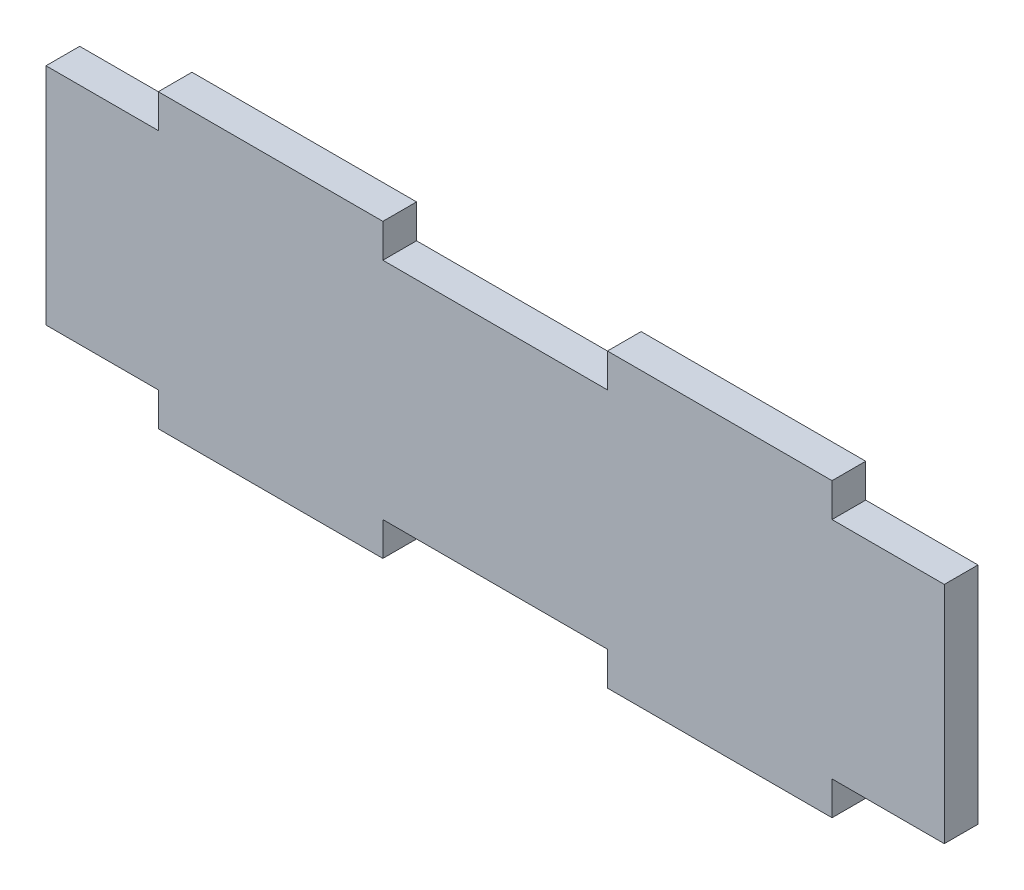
ISO-10303-21;
HEADER;
FILE_DESCRIPTION(('STEP AP214'),'2;1');
FILE_NAME('part.step','',(''),(''),'','','');
FILE_SCHEMA(('AUTOMOTIVE_DESIGN { 1 0 10303 214 1 1 1 1 }'));
ENDSEC;
DATA;
#1=APPLICATION_CONTEXT('core data for automotive mechanical design processes');
#2=APPLICATION_PROTOCOL_DEFINITION('international standard','automotive_design',2000,#1);
#3=PRODUCT_CONTEXT('',#1,'mechanical');
#4=PRODUCT('Part','Part','',(#3));
#5=PRODUCT_RELATED_PRODUCT_CATEGORY('part','',(#4));
#6=PRODUCT_DEFINITION_FORMATION('','',#4);
#7=PRODUCT_DEFINITION_CONTEXT('part definition',#1,'design');
#8=PRODUCT_DEFINITION('design','',#6,#7);
#9=PRODUCT_DEFINITION_SHAPE('','',#8);
#10=(LENGTH_UNIT() NAMED_UNIT(*) SI_UNIT(.MILLI.,.METRE.));
#11=(NAMED_UNIT(*) PLANE_ANGLE_UNIT() SI_UNIT($,.RADIAN.));
#12=(NAMED_UNIT(*) SI_UNIT($,.STERADIAN.) SOLID_ANGLE_UNIT());
#13=UNCERTAINTY_MEASURE_WITH_UNIT(LENGTH_MEASURE(1.E-05),#10,'distance_accuracy_value','');
#14=(GEOMETRIC_REPRESENTATION_CONTEXT(3) GLOBAL_UNCERTAINTY_ASSIGNED_CONTEXT((#13)) GLOBAL_UNIT_ASSIGNED_CONTEXT((#10,
#11,#12)) REPRESENTATION_CONTEXT('',''));
#15=CARTESIAN_POINT('',(0.,0.,0.));
#16=DIRECTION('',(0.,0.,1.));
#17=DIRECTION('',(1.,0.,0.));
#18=AXIS2_PLACEMENT_3D('',#15,#16,#17);
#19=CARTESIAN_POINT('',(0.,0.,3.));
#20=DIRECTION('',(-1.,0.,0.));
#21=DIRECTION('',(0.,0.,1.));
#22=AXIS2_PLACEMENT_3D('',#19,#20,#21);
#23=PLANE('',#22);
#24=DIRECTION('',(0.,1.,0.));
#25=VECTOR('',#24,1.);
#26=CARTESIAN_POINT('',(0.,0.,0.));
#27=LINE('',#26,#25);
#28=CARTESIAN_POINT('',(0.,0.,0.));
#29=VERTEX_POINT('',#28);
#30=CARTESIAN_POINT('',(0.,20.,0.));
#31=VERTEX_POINT('',#30);
#32=EDGE_CURVE('E171',#29,#31,#27,.T.);
#33=ORIENTED_EDGE('',*,*,#32,.F.);
#34=DIRECTION('',(0.,0.,-1.));
#35=VECTOR('',#34,1.);
#36=CARTESIAN_POINT('',(0.,0.,3.));
#37=LINE('',#36,#35);
#38=CARTESIAN_POINT('',(0.,0.,3.));
#39=VERTEX_POINT('',#38);
#40=EDGE_CURVE('E183',#39,#29,#37,.T.);
#41=ORIENTED_EDGE('',*,*,#40,.F.);
#42=DIRECTION('',(0.,1.,0.));
#43=VECTOR('',#42,1.);
#44=CARTESIAN_POINT('',(0.,0.,3.));
#45=LINE('',#44,#43);
#46=CARTESIAN_POINT('',(0.,20.,3.));
#47=VERTEX_POINT('',#46);
#48=EDGE_CURVE('E179',#39,#47,#45,.T.);
#49=ORIENTED_EDGE('',*,*,#48,.T.);
#50=DIRECTION('',(0.,0.,-1.));
#51=VECTOR('',#50,1.);
#52=CARTESIAN_POINT('',(0.,20.,3.));
#53=LINE('',#52,#51);
#54=EDGE_CURVE('E201',#47,#31,#53,.T.);
#55=ORIENTED_EDGE('',*,*,#54,.T.);
#56=EDGE_LOOP('',(#33,#41,#49,#55));
#57=FACE_BOUND('',#56,.T.);
#58=ADVANCED_FACE('F34',(#57),#23,.T.);
#59=CARTESIAN_POINT('',(80.,0.,3.));
#60=DIRECTION('',(-1.,0.,0.));
#61=DIRECTION('',(0.,0.,1.));
#62=AXIS2_PLACEMENT_3D('',#59,#60,#61);
#63=PLANE('',#62);
#64=DIRECTION('',(0.,1.,0.));
#65=VECTOR('',#64,1.);
#66=CARTESIAN_POINT('',(80.,0.,0.));
#67=LINE('',#66,#65);
#68=CARTESIAN_POINT('',(80.,0.,0.));
#69=VERTEX_POINT('',#68);
#70=CARTESIAN_POINT('',(80.,20.,0.));
#71=VERTEX_POINT('',#70);
#72=EDGE_CURVE('E187',#69,#71,#67,.T.);
#73=ORIENTED_EDGE('',*,*,#72,.T.);
#74=DIRECTION('',(0.,0.,-1.));
#75=VECTOR('',#74,1.);
#76=CARTESIAN_POINT('',(80.,20.,3.));
#77=LINE('',#76,#75);
#78=CARTESIAN_POINT('',(80.,20.,3.));
#79=VERTEX_POINT('',#78);
#80=EDGE_CURVE('E204',#79,#71,#77,.T.);
#81=ORIENTED_EDGE('',*,*,#80,.F.);
#82=DIRECTION('',(0.,1.,0.));
#83=VECTOR('',#82,1.);
#84=CARTESIAN_POINT('',(80.,0.,3.));
#85=LINE('',#84,#83);
#86=CARTESIAN_POINT('',(80.,0.,3.));
#87=VERTEX_POINT('',#86);
#88=EDGE_CURVE('E169',#87,#79,#85,.T.);
#89=ORIENTED_EDGE('',*,*,#88,.F.);
#90=DIRECTION('',(0.,0.,-1.));
#91=VECTOR('',#90,1.);
#92=CARTESIAN_POINT('',(80.,0.,3.));
#93=LINE('',#92,#91);
#94=EDGE_CURVE('E207',#87,#69,#93,.T.);
#95=ORIENTED_EDGE('',*,*,#94,.T.);
#96=EDGE_LOOP('',(#73,#81,#89,#95));
#97=FACE_BOUND('',#96,.T.);
#98=ADVANCED_FACE('F370',(#97),#63,.F.);
#99=CARTESIAN_POINT('',(0.,0.,0.));
#100=DIRECTION('',(0.,0.,1.));
#101=DIRECTION('',(1.,0.,0.));
#102=AXIS2_PLACEMENT_3D('',#99,#100,#101);
#103=PLANE('',#102);
#104=DIRECTION('',(1.,0.,0.));
#105=VECTOR('',#104,1.);
#106=CARTESIAN_POINT('',(0.,0.,0.));
#107=LINE('',#106,#105);
#108=CARTESIAN_POINT('',(10.,0.,0.));
#109=VERTEX_POINT('',#108);
#110=EDGE_CURVE('E184',#29,#109,#107,.T.);
#111=ORIENTED_EDGE('',*,*,#110,.F.);
#112=ORIENTED_EDGE('',*,*,#32,.T.);
#113=DIRECTION('',(1.,0.,0.));
#114=VECTOR('',#113,1.);
#115=CARTESIAN_POINT('',(0.,20.,0.));
#116=LINE('',#115,#114);
#117=CARTESIAN_POINT('',(10.,20.,0.));
#118=VERTEX_POINT('',#117);
#119=EDGE_CURVE('E193',#31,#118,#116,.T.);
#120=ORIENTED_EDGE('',*,*,#119,.T.);
#121=DIRECTION('',(0.,1.,0.));
#122=VECTOR('',#121,1.);
#123=CARTESIAN_POINT('',(10.,20.,0.));
#124=LINE('',#123,#122);
#125=CARTESIAN_POINT('',(10.,23.,0.));
#126=VERTEX_POINT('',#125);
#127=EDGE_CURVE('E221',#118,#126,#124,.T.);
#128=ORIENTED_EDGE('',*,*,#127,.T.);
#129=DIRECTION('',(1.,0.,0.));
#130=VECTOR('',#129,1.);
#131=CARTESIAN_POINT('',(10.,23.,0.));
#132=LINE('',#131,#130);
#133=CARTESIAN_POINT('',(30.,23.,0.));
#134=VERTEX_POINT('',#133);
#135=EDGE_CURVE('E224',#126,#134,#132,.T.);
#136=ORIENTED_EDGE('',*,*,#135,.T.);
#137=DIRECTION('',(0.,1.,0.));
#138=VECTOR('',#137,1.);
#139=CARTESIAN_POINT('',(30.,20.,0.));
#140=LINE('',#139,#138);
#141=CARTESIAN_POINT('',(30.,20.,0.));
#142=VERTEX_POINT('',#141);
#143=EDGE_CURVE('E215',#142,#134,#140,.T.);
#144=ORIENTED_EDGE('',*,*,#143,.F.);
#145=CARTESIAN_POINT('',(50.,20.,0.));
#146=VERTEX_POINT('',#145);
#147=EDGE_CURVE('E196',#142,#146,#116,.T.);
#148=ORIENTED_EDGE('',*,*,#147,.T.);
#149=DIRECTION('',(0.,1.,0.));
#150=VECTOR('',#149,1.);
#151=CARTESIAN_POINT('',(50.,20.,0.));
#152=LINE('',#151,#150);
#153=CARTESIAN_POINT('',(50.,23.,0.));
#154=VERTEX_POINT('',#153);
#155=EDGE_CURVE('E243',#146,#154,#152,.T.);
#156=ORIENTED_EDGE('',*,*,#155,.T.);
#157=DIRECTION('',(-1.,0.,0.));
#158=VECTOR('',#157,1.);
#159=CARTESIAN_POINT('',(70.,23.,0.));
#160=LINE('',#159,#158);
#161=CARTESIAN_POINT('',(70.,23.,0.));
#162=VERTEX_POINT('',#161);
#163=EDGE_CURVE('E251',#162,#154,#160,.T.);
#164=ORIENTED_EDGE('',*,*,#163,.F.);
#165=DIRECTION('',(0.,1.,0.));
#166=VECTOR('',#165,1.);
#167=CARTESIAN_POINT('',(70.,20.,0.));
#168=LINE('',#167,#166);
#169=CARTESIAN_POINT('',(70.,20.,0.));
#170=VERTEX_POINT('',#169);
#171=EDGE_CURVE('E156',#170,#162,#168,.T.);
#172=ORIENTED_EDGE('',*,*,#171,.F.);
#173=EDGE_CURVE('E192',#170,#71,#116,.T.);
#174=ORIENTED_EDGE('',*,*,#173,.T.);
#175=ORIENTED_EDGE('',*,*,#72,.F.);
#176=CARTESIAN_POINT('',(70.,0.,0.));
#177=VERTEX_POINT('',#176);
#178=EDGE_CURVE('E189',#177,#69,#107,.T.);
#179=ORIENTED_EDGE('',*,*,#178,.F.);
#180=DIRECTION('',(0.,-1.,0.));
#181=VECTOR('',#180,1.);
#182=CARTESIAN_POINT('',(70.,0.,0.));
#183=LINE('',#182,#181);
#184=CARTESIAN_POINT('',(70.,-3.,0.));
#185=VERTEX_POINT('',#184);
#186=EDGE_CURVE('E134',#177,#185,#183,.T.);
#187=ORIENTED_EDGE('',*,*,#186,.T.);
#188=DIRECTION('',(-1.,0.,0.));
#189=VECTOR('',#188,1.);
#190=CARTESIAN_POINT('',(70.,-3.,0.));
#191=LINE('',#190,#189);
#192=CARTESIAN_POINT('',(50.,-3.,0.));
#193=VERTEX_POINT('',#192);
#194=EDGE_CURVE('E113',#185,#193,#191,.T.);
#195=ORIENTED_EDGE('',*,*,#194,.T.);
#196=DIRECTION('',(0.,-1.,0.));
#197=VECTOR('',#196,1.);
#198=CARTESIAN_POINT('',(50.,0.,0.));
#199=LINE('',#198,#197);
#200=CARTESIAN_POINT('',(50.,0.,0.));
#201=VERTEX_POINT('',#200);
#202=EDGE_CURVE('E122',#201,#193,#199,.T.);
#203=ORIENTED_EDGE('',*,*,#202,.F.);
#204=CARTESIAN_POINT('',(30.,0.,0.));
#205=VERTEX_POINT('',#204);
#206=EDGE_CURVE('E188',#205,#201,#107,.T.);
#207=ORIENTED_EDGE('',*,*,#206,.F.);
#208=DIRECTION('',(0.,-1.,0.));
#209=VECTOR('',#208,1.);
#210=CARTESIAN_POINT('',(30.,0.,0.));
#211=LINE('',#210,#209);
#212=CARTESIAN_POINT('',(30.,-3.,0.));
#213=VERTEX_POINT('',#212);
#214=EDGE_CURVE('E267',#205,#213,#211,.T.);
#215=ORIENTED_EDGE('',*,*,#214,.T.);
#216=DIRECTION('',(1.,0.,0.));
#217=VECTOR('',#216,1.);
#218=CARTESIAN_POINT('',(10.,-3.,0.));
#219=LINE('',#218,#217);
#220=CARTESIAN_POINT('',(10.,-3.,0.));
#221=VERTEX_POINT('',#220);
#222=EDGE_CURVE('E272',#221,#213,#219,.T.);
#223=ORIENTED_EDGE('',*,*,#222,.F.);
#224=DIRECTION('',(0.,-1.,0.));
#225=VECTOR('',#224,1.);
#226=CARTESIAN_POINT('',(10.,0.,0.));
#227=LINE('',#226,#225);
#228=EDGE_CURVE('E119',#109,#221,#227,.T.);
#229=ORIENTED_EDGE('',*,*,#228,.F.);
#230=EDGE_LOOP('',(#111,#112,#120,#128,#136,#144,#148,#156,#164,#172,#174,#175,#179,#187,#195,
#203,#207,#215,#223,#229));
#231=FACE_BOUND('',#230,.T.);
#232=ADVANCED_FACE('F132',(#231),#103,.F.);
#233=CARTESIAN_POINT('',(0.,0.,3.));
#234=DIRECTION('',(0.,0.,1.));
#235=DIRECTION('',(1.,0.,0.));
#236=AXIS2_PLACEMENT_3D('',#233,#234,#235);
#237=PLANE('',#236);
#238=DIRECTION('',(1.,0.,0.));
#239=VECTOR('',#238,1.);
#240=CARTESIAN_POINT('',(0.,0.,3.));
#241=LINE('',#240,#239);
#242=CARTESIAN_POINT('',(10.,0.,3.));
#243=VERTEX_POINT('',#242);
#244=EDGE_CURVE('E166',#39,#243,#241,.T.);
#245=ORIENTED_EDGE('',*,*,#244,.T.);
#246=DIRECTION('',(0.,-1.,0.));
#247=VECTOR('',#246,1.);
#248=CARTESIAN_POINT('',(10.,0.,3.));
#249=LINE('',#248,#247);
#250=CARTESIAN_POINT('',(10.,-3.,3.));
#251=VERTEX_POINT('',#250);
#252=EDGE_CURVE('E263',#243,#251,#249,.T.);
#253=ORIENTED_EDGE('',*,*,#252,.T.);
#254=DIRECTION('',(1.,0.,0.));
#255=VECTOR('',#254,1.);
#256=CARTESIAN_POINT('',(10.,-3.,3.));
#257=LINE('',#256,#255);
#258=CARTESIAN_POINT('',(30.,-3.,3.));
#259=VERTEX_POINT('',#258);
#260=EDGE_CURVE('E266',#251,#259,#257,.T.);
#261=ORIENTED_EDGE('',*,*,#260,.T.);
#262=DIRECTION('',(0.,-1.,0.));
#263=VECTOR('',#262,1.);
#264=CARTESIAN_POINT('',(30.,0.,3.));
#265=LINE('',#264,#263);
#266=CARTESIAN_POINT('',(30.,0.,3.));
#267=VERTEX_POINT('',#266);
#268=EDGE_CURVE('E153',#267,#259,#265,.T.);
#269=ORIENTED_EDGE('',*,*,#268,.F.);
#270=CARTESIAN_POINT('',(50.,0.,3.));
#271=VERTEX_POINT('',#270);
#272=EDGE_CURVE('E164',#267,#271,#241,.T.);
#273=ORIENTED_EDGE('',*,*,#272,.T.);
#274=DIRECTION('',(0.,-1.,0.));
#275=VECTOR('',#274,1.);
#276=CARTESIAN_POINT('',(50.,0.,3.));
#277=LINE('',#276,#275);
#278=CARTESIAN_POINT('',(50.,-3.,3.));
#279=VERTEX_POINT('',#278);
#280=EDGE_CURVE('E158',#271,#279,#277,.T.);
#281=ORIENTED_EDGE('',*,*,#280,.T.);
#282=DIRECTION('',(-1.,0.,0.));
#283=VECTOR('',#282,1.);
#284=CARTESIAN_POINT('',(70.,-3.,3.));
#285=LINE('',#284,#283);
#286=CARTESIAN_POINT('',(70.,-3.,3.));
#287=VERTEX_POINT('',#286);
#288=EDGE_CURVE('E116',#287,#279,#285,.T.);
#289=ORIENTED_EDGE('',*,*,#288,.F.);
#290=DIRECTION('',(0.,-1.,0.));
#291=VECTOR('',#290,1.);
#292=CARTESIAN_POINT('',(70.,0.,3.));
#293=LINE('',#292,#291);
#294=CARTESIAN_POINT('',(70.,0.,3.));
#295=VERTEX_POINT('',#294);
#296=EDGE_CURVE('E129',#295,#287,#293,.T.);
#297=ORIENTED_EDGE('',*,*,#296,.F.);
#298=EDGE_CURVE('E167',#295,#87,#241,.T.);
#299=ORIENTED_EDGE('',*,*,#298,.T.);
#300=ORIENTED_EDGE('',*,*,#88,.T.);
#301=DIRECTION('',(1.,0.,0.));
#302=VECTOR('',#301,1.);
#303=CARTESIAN_POINT('',(0.,20.,3.));
#304=LINE('',#303,#302);
#305=CARTESIAN_POINT('',(70.,20.,3.));
#306=VERTEX_POINT('',#305);
#307=EDGE_CURVE('E175',#306,#79,#304,.T.);
#308=ORIENTED_EDGE('',*,*,#307,.F.);
#309=DIRECTION('',(0.,1.,0.));
#310=VECTOR('',#309,1.);
#311=CARTESIAN_POINT('',(70.,20.,3.));
#312=LINE('',#311,#310);
#313=CARTESIAN_POINT('',(70.,23.,3.));
#314=VERTEX_POINT('',#313);
#315=EDGE_CURVE('E239',#306,#314,#312,.T.);
#316=ORIENTED_EDGE('',*,*,#315,.T.);
#317=DIRECTION('',(-1.,0.,0.));
#318=VECTOR('',#317,1.);
#319=CARTESIAN_POINT('',(70.,23.,3.));
#320=LINE('',#319,#318);
#321=CARTESIAN_POINT('',(50.,23.,3.));
#322=VERTEX_POINT('',#321);
#323=EDGE_CURVE('E242',#314,#322,#320,.T.);
#324=ORIENTED_EDGE('',*,*,#323,.T.);
#325=DIRECTION('',(0.,1.,0.));
#326=VECTOR('',#325,1.);
#327=CARTESIAN_POINT('',(50.,20.,3.));
#328=LINE('',#327,#326);
#329=CARTESIAN_POINT('',(50.,20.,3.));
#330=VERTEX_POINT('',#329);
#331=EDGE_CURVE('E245',#330,#322,#328,.T.);
#332=ORIENTED_EDGE('',*,*,#331,.F.);
#333=CARTESIAN_POINT('',(30.,20.,3.));
#334=VERTEX_POINT('',#333);
#335=EDGE_CURVE('E180',#334,#330,#304,.T.);
#336=ORIENTED_EDGE('',*,*,#335,.F.);
#337=DIRECTION('',(0.,1.,0.));
#338=VECTOR('',#337,1.);
#339=CARTESIAN_POINT('',(30.,20.,3.));
#340=LINE('',#339,#338);
#341=CARTESIAN_POINT('',(30.,23.,3.));
#342=VERTEX_POINT('',#341);
#343=EDGE_CURVE('E218',#334,#342,#340,.T.);
#344=ORIENTED_EDGE('',*,*,#343,.T.);
#345=DIRECTION('',(1.,0.,0.));
#346=VECTOR('',#345,1.);
#347=CARTESIAN_POINT('',(10.,23.,3.));
#348=LINE('',#347,#346);
#349=CARTESIAN_POINT('',(10.,23.,3.));
#350=VERTEX_POINT('',#349);
#351=EDGE_CURVE('E214',#350,#342,#348,.T.);
#352=ORIENTED_EDGE('',*,*,#351,.F.);
#353=DIRECTION('',(0.,1.,0.));
#354=VECTOR('',#353,1.);
#355=CARTESIAN_POINT('',(10.,20.,3.));
#356=LINE('',#355,#354);
#357=CARTESIAN_POINT('',(10.,20.,3.));
#358=VERTEX_POINT('',#357);
#359=EDGE_CURVE('E211',#358,#350,#356,.T.);
#360=ORIENTED_EDGE('',*,*,#359,.F.);
#361=EDGE_CURVE('E176',#47,#358,#304,.T.);
#362=ORIENTED_EDGE('',*,*,#361,.F.);
#363=ORIENTED_EDGE('',*,*,#48,.F.);
#364=EDGE_LOOP('',(#245,#253,#261,#269,#273,#281,#289,#297,#299,#300,#308,#316,#324,#332,#336,
#344,#352,#360,#362,#363));
#365=FACE_BOUND('',#364,.T.);
#366=ADVANCED_FACE('F162',(#365),#237,.T.);
#367=CARTESIAN_POINT('',(0.,20.,3.));
#368=DIRECTION('',(0.,1.,0.));
#369=DIRECTION('',(0.,0.,1.));
#370=AXIS2_PLACEMENT_3D('',#367,#368,#369);
#371=PLANE('',#370);
#372=DIRECTION('',(0.,0.,-1.));
#373=VECTOR('',#372,1.);
#374=CARTESIAN_POINT('',(30.,20.,3.));
#375=LINE('',#374,#373);
#376=EDGE_CURVE('E140',#334,#142,#375,.T.);
#377=ORIENTED_EDGE('',*,*,#376,.F.);
#378=ORIENTED_EDGE('',*,*,#335,.T.);
#379=DIRECTION('',(0.,0.,-1.));
#380=VECTOR('',#379,1.);
#381=CARTESIAN_POINT('',(50.,20.,3.));
#382=LINE('',#381,#380);
#383=EDGE_CURVE('E210',#330,#146,#382,.T.);
#384=ORIENTED_EDGE('',*,*,#383,.T.);
#385=ORIENTED_EDGE('',*,*,#147,.F.);
#386=EDGE_LOOP('',(#377,#378,#384,#385));
#387=FACE_BOUND('',#386,.T.);
#388=ADVANCED_FACE('F356',(#387),#371,.T.);
#389=DIRECTION('',(0.,0.,-1.));
#390=VECTOR('',#389,1.);
#391=CARTESIAN_POINT('',(70.,20.,3.));
#392=LINE('',#391,#390);
#393=EDGE_CURVE('E233',#306,#170,#392,.T.);
#394=ORIENTED_EDGE('',*,*,#393,.F.);
#395=ORIENTED_EDGE('',*,*,#307,.T.);
#396=ORIENTED_EDGE('',*,*,#80,.T.);
#397=ORIENTED_EDGE('',*,*,#173,.F.);
#398=EDGE_LOOP('',(#394,#395,#396,#397));
#399=FACE_BOUND('',#398,.T.);
#400=ADVANCED_FACE('F345',(#399),#371,.T.);
#401=ORIENTED_EDGE('',*,*,#361,.T.);
#402=DIRECTION('',(0.,0.,-1.));
#403=VECTOR('',#402,1.);
#404=CARTESIAN_POINT('',(10.,20.,3.));
#405=LINE('',#404,#403);
#406=EDGE_CURVE('E230',#358,#118,#405,.T.);
#407=ORIENTED_EDGE('',*,*,#406,.T.);
#408=ORIENTED_EDGE('',*,*,#119,.F.);
#409=ORIENTED_EDGE('',*,*,#54,.F.);
#410=EDGE_LOOP('',(#401,#407,#408,#409));
#411=FACE_BOUND('',#410,.T.);
#412=ADVANCED_FACE('F398',(#411),#371,.T.);
#413=CARTESIAN_POINT('',(0.,0.,3.));
#414=DIRECTION('',(0.,1.,0.));
#415=DIRECTION('',(0.,0.,1.));
#416=AXIS2_PLACEMENT_3D('',#413,#414,#415);
#417=PLANE('',#416);
#418=ORIENTED_EDGE('',*,*,#298,.F.);
#419=DIRECTION('',(0.,0.,-1.));
#420=VECTOR('',#419,1.);
#421=CARTESIAN_POINT('',(70.,0.,3.));
#422=LINE('',#421,#420);
#423=EDGE_CURVE('E53',#295,#177,#422,.T.);
#424=ORIENTED_EDGE('',*,*,#423,.T.);
#425=ORIENTED_EDGE('',*,*,#178,.T.);
#426=ORIENTED_EDGE('',*,*,#94,.F.);
#427=EDGE_LOOP('',(#418,#424,#425,#426));
#428=FACE_BOUND('',#427,.T.);
#429=ADVANCED_FACE('F374',(#428),#417,.F.);
#430=ORIENTED_EDGE('',*,*,#272,.F.);
#431=DIRECTION('',(0.,0.,-1.));
#432=VECTOR('',#431,1.);
#433=CARTESIAN_POINT('',(30.,0.,3.));
#434=LINE('',#433,#432);
#435=EDGE_CURVE('E44',#267,#205,#434,.T.);
#436=ORIENTED_EDGE('',*,*,#435,.T.);
#437=ORIENTED_EDGE('',*,*,#206,.T.);
#438=DIRECTION('',(0.,0.,-1.));
#439=VECTOR('',#438,1.);
#440=CARTESIAN_POINT('',(50.,0.,3.));
#441=LINE('',#440,#439);
#442=EDGE_CURVE('E125',#271,#201,#441,.T.);
#443=ORIENTED_EDGE('',*,*,#442,.F.);
#444=EDGE_LOOP('',(#430,#436,#437,#443));
#445=FACE_BOUND('',#444,.T.);
#446=ADVANCED_FACE('F402',(#445),#417,.F.);
#447=DIRECTION('',(0.,0.,-1.));
#448=VECTOR('',#447,1.);
#449=CARTESIAN_POINT('',(10.,0.,3.));
#450=LINE('',#449,#448);
#451=EDGE_CURVE('E11',#243,#109,#450,.T.);
#452=ORIENTED_EDGE('',*,*,#451,.F.);
#453=ORIENTED_EDGE('',*,*,#244,.F.);
#454=ORIENTED_EDGE('',*,*,#40,.T.);
#455=ORIENTED_EDGE('',*,*,#110,.T.);
#456=EDGE_LOOP('',(#452,#453,#454,#455));
#457=FACE_BOUND('',#456,.T.);
#458=ADVANCED_FACE('F293',(#457),#417,.F.);
#459=CARTESIAN_POINT('',(70.,23.,3.));
#460=DIRECTION('',(0.,-1.,0.));
#461=DIRECTION('',(0.,0.,-1.));
#462=AXIS2_PLACEMENT_3D('',#459,#460,#461);
#463=PLANE('',#462);
#464=ORIENTED_EDGE('',*,*,#163,.T.);
#465=DIRECTION('',(0.,0.,-1.));
#466=VECTOR('',#465,1.);
#467=CARTESIAN_POINT('',(50.,23.,3.));
#468=LINE('',#467,#466);
#469=EDGE_CURVE('E248',#322,#154,#468,.T.);
#470=ORIENTED_EDGE('',*,*,#469,.F.);
#471=ORIENTED_EDGE('',*,*,#323,.F.);
#472=DIRECTION('',(0.,0.,-1.));
#473=VECTOR('',#472,1.);
#474=CARTESIAN_POINT('',(70.,23.,3.));
#475=LINE('',#474,#473);
#476=EDGE_CURVE('E225',#314,#162,#475,.T.);
#477=ORIENTED_EDGE('',*,*,#476,.T.);
#478=EDGE_LOOP('',(#464,#470,#471,#477));
#479=FACE_BOUND('',#478,.T.);
#480=ADVANCED_FACE('F411',(#479),#463,.F.);
#481=CARTESIAN_POINT('',(50.,20.,3.));
#482=DIRECTION('',(-1.,0.,0.));
#483=DIRECTION('',(0.,0.,1.));
#484=AXIS2_PLACEMENT_3D('',#481,#482,#483);
#485=PLANE('',#484);
#486=ORIENTED_EDGE('',*,*,#155,.F.);
#487=ORIENTED_EDGE('',*,*,#383,.F.);
#488=ORIENTED_EDGE('',*,*,#331,.T.);
#489=ORIENTED_EDGE('',*,*,#469,.T.);
#490=EDGE_LOOP('',(#486,#487,#488,#489));
#491=FACE_BOUND('',#490,.T.);
#492=ADVANCED_FACE('F365',(#491),#485,.T.);
#493=CARTESIAN_POINT('',(70.,20.,3.));
#494=DIRECTION('',(-1.,0.,0.));
#495=DIRECTION('',(0.,0.,1.));
#496=AXIS2_PLACEMENT_3D('',#493,#494,#495);
#497=PLANE('',#496);
#498=ORIENTED_EDGE('',*,*,#171,.T.);
#499=ORIENTED_EDGE('',*,*,#476,.F.);
#500=ORIENTED_EDGE('',*,*,#315,.F.);
#501=ORIENTED_EDGE('',*,*,#393,.T.);
#502=EDGE_LOOP('',(#498,#499,#500,#501));
#503=FACE_BOUND('',#502,.T.);
#504=ADVANCED_FACE('F350',(#503),#497,.F.);
#505=CARTESIAN_POINT('',(10.,23.,3.));
#506=DIRECTION('',(0.,1.,0.));
#507=DIRECTION('',(0.,0.,1.));
#508=AXIS2_PLACEMENT_3D('',#505,#506,#507);
#509=PLANE('',#508);
#510=ORIENTED_EDGE('',*,*,#135,.F.);
#511=DIRECTION('',(0.,0.,-1.));
#512=VECTOR('',#511,1.);
#513=CARTESIAN_POINT('',(10.,23.,3.));
#514=LINE('',#513,#512);
#515=EDGE_CURVE('E220',#350,#126,#514,.T.);
#516=ORIENTED_EDGE('',*,*,#515,.F.);
#517=ORIENTED_EDGE('',*,*,#351,.T.);
#518=DIRECTION('',(0.,0.,-1.));
#519=VECTOR('',#518,1.);
#520=CARTESIAN_POINT('',(30.,23.,3.));
#521=LINE('',#520,#519);
#522=EDGE_CURVE('E236',#342,#134,#521,.T.);
#523=ORIENTED_EDGE('',*,*,#522,.T.);
#524=EDGE_LOOP('',(#510,#516,#517,#523));
#525=FACE_BOUND('',#524,.T.);
#526=ADVANCED_FACE('F376',(#525),#509,.T.);
#527=CARTESIAN_POINT('',(10.,20.,3.));
#528=DIRECTION('',(-1.,0.,0.));
#529=DIRECTION('',(0.,0.,1.));
#530=AXIS2_PLACEMENT_3D('',#527,#528,#529);
#531=PLANE('',#530);
#532=ORIENTED_EDGE('',*,*,#127,.F.);
#533=ORIENTED_EDGE('',*,*,#406,.F.);
#534=ORIENTED_EDGE('',*,*,#359,.T.);
#535=ORIENTED_EDGE('',*,*,#515,.T.);
#536=EDGE_LOOP('',(#532,#533,#534,#535));
#537=FACE_BOUND('',#536,.T.);
#538=ADVANCED_FACE('F385',(#537),#531,.T.);
#539=CARTESIAN_POINT('',(30.,20.,3.));
#540=DIRECTION('',(-1.,0.,0.));
#541=DIRECTION('',(0.,0.,1.));
#542=AXIS2_PLACEMENT_3D('',#539,#540,#541);
#543=PLANE('',#542);
#544=ORIENTED_EDGE('',*,*,#143,.T.);
#545=ORIENTED_EDGE('',*,*,#522,.F.);
#546=ORIENTED_EDGE('',*,*,#343,.F.);
#547=ORIENTED_EDGE('',*,*,#376,.T.);
#548=EDGE_LOOP('',(#544,#545,#546,#547));
#549=FACE_BOUND('',#548,.T.);
#550=ADVANCED_FACE('F383',(#549),#543,.F.);
#551=CARTESIAN_POINT('',(70.,-3.,3.));
#552=DIRECTION('',(0.,-1.,0.));
#553=DIRECTION('',(0.,0.,-1.));
#554=AXIS2_PLACEMENT_3D('',#551,#552,#553);
#555=PLANE('',#554);
#556=ORIENTED_EDGE('',*,*,#194,.F.);
#557=DIRECTION('',(0.,0.,-1.));
#558=VECTOR('',#557,1.);
#559=CARTESIAN_POINT('',(70.,-3.,3.));
#560=LINE('',#559,#558);
#561=EDGE_CURVE('E38',#287,#185,#560,.T.);
#562=ORIENTED_EDGE('',*,*,#561,.F.);
#563=ORIENTED_EDGE('',*,*,#288,.T.);
#564=DIRECTION('',(0.,0.,-1.));
#565=VECTOR('',#564,1.);
#566=CARTESIAN_POINT('',(50.,-3.,3.));
#567=LINE('',#566,#565);
#568=EDGE_CURVE('E109',#279,#193,#567,.T.);
#569=ORIENTED_EDGE('',*,*,#568,.T.);
#570=EDGE_LOOP('',(#556,#562,#563,#569));
#571=FACE_BOUND('',#570,.T.);
#572=ADVANCED_FACE('F111',(#571),#555,.T.);
#573=CARTESIAN_POINT('',(70.,0.,3.));
#574=DIRECTION('',(1.,0.,0.));
#575=DIRECTION('',(0.,0.,-1.));
#576=AXIS2_PLACEMENT_3D('',#573,#574,#575);
#577=PLANE('',#576);
#578=ORIENTED_EDGE('',*,*,#186,.F.);
#579=ORIENTED_EDGE('',*,*,#423,.F.);
#580=ORIENTED_EDGE('',*,*,#296,.T.);
#581=ORIENTED_EDGE('',*,*,#561,.T.);
#582=EDGE_LOOP('',(#578,#579,#580,#581));
#583=FACE_BOUND('',#582,.T.);
#584=ADVANCED_FACE('F36',(#583),#577,.T.);
#585=CARTESIAN_POINT('',(50.,0.,3.));
#586=DIRECTION('',(1.,0.,0.));
#587=DIRECTION('',(0.,0.,-1.));
#588=AXIS2_PLACEMENT_3D('',#585,#586,#587);
#589=PLANE('',#588);
#590=ORIENTED_EDGE('',*,*,#202,.T.);
#591=ORIENTED_EDGE('',*,*,#568,.F.);
#592=ORIENTED_EDGE('',*,*,#280,.F.);
#593=ORIENTED_EDGE('',*,*,#442,.T.);
#594=EDGE_LOOP('',(#590,#591,#592,#593));
#595=FACE_BOUND('',#594,.T.);
#596=ADVANCED_FACE('F123',(#595),#589,.F.);
#597=CARTESIAN_POINT('',(10.,-3.,3.));
#598=DIRECTION('',(0.,1.,0.));
#599=DIRECTION('',(0.,0.,1.));
#600=AXIS2_PLACEMENT_3D('',#597,#598,#599);
#601=PLANE('',#600);
#602=ORIENTED_EDGE('',*,*,#222,.T.);
#603=DIRECTION('',(0.,0.,-1.));
#604=VECTOR('',#603,1.);
#605=CARTESIAN_POINT('',(30.,-3.,3.));
#606=LINE('',#605,#604);
#607=EDGE_CURVE('E150',#259,#213,#606,.T.);
#608=ORIENTED_EDGE('',*,*,#607,.F.);
#609=ORIENTED_EDGE('',*,*,#260,.F.);
#610=DIRECTION('',(0.,0.,-1.));
#611=VECTOR('',#610,1.);
#612=CARTESIAN_POINT('',(10.,-3.,3.));
#613=LINE('',#612,#611);
#614=EDGE_CURVE('E152',#251,#221,#613,.T.);
#615=ORIENTED_EDGE('',*,*,#614,.T.);
#616=EDGE_LOOP('',(#602,#608,#609,#615));
#617=FACE_BOUND('',#616,.T.);
#618=ADVANCED_FACE('F381',(#617),#601,.F.);
#619=CARTESIAN_POINT('',(30.,0.,3.));
#620=DIRECTION('',(1.,0.,0.));
#621=DIRECTION('',(0.,0.,-1.));
#622=AXIS2_PLACEMENT_3D('',#619,#620,#621);
#623=PLANE('',#622);
#624=ORIENTED_EDGE('',*,*,#214,.F.);
#625=ORIENTED_EDGE('',*,*,#435,.F.);
#626=ORIENTED_EDGE('',*,*,#268,.T.);
#627=ORIENTED_EDGE('',*,*,#607,.T.);
#628=EDGE_LOOP('',(#624,#625,#626,#627));
#629=FACE_BOUND('',#628,.T.);
#630=ADVANCED_FACE('F277',(#629),#623,.T.);
#631=CARTESIAN_POINT('',(10.,0.,3.));
#632=DIRECTION('',(1.,0.,0.));
#633=DIRECTION('',(0.,0.,-1.));
#634=AXIS2_PLACEMENT_3D('',#631,#632,#633);
#635=PLANE('',#634);
#636=ORIENTED_EDGE('',*,*,#228,.T.);
#637=ORIENTED_EDGE('',*,*,#614,.F.);
#638=ORIENTED_EDGE('',*,*,#252,.F.);
#639=ORIENTED_EDGE('',*,*,#451,.T.);
#640=EDGE_LOOP('',(#636,#637,#638,#639));
#641=FACE_BOUND('',#640,.T.);
#642=ADVANCED_FACE('F298',(#641),#635,.F.);
#643=CLOSED_SHELL('',(#58,#98,#232,#366,#388,#400,#412,#429,#446,#458,#480,#492,#504,#526,#538,
#550,#572,#584,#596,#618,#630,#642));
#644=MANIFOLD_SOLID_BREP('B2',#643);
#645=ADVANCED_BREP_SHAPE_REPRESENTATION('',(#18,#644),#14);
#646=SHAPE_DEFINITION_REPRESENTATION(#9,#645);
ENDSEC;
END-ISO-10303-21;
